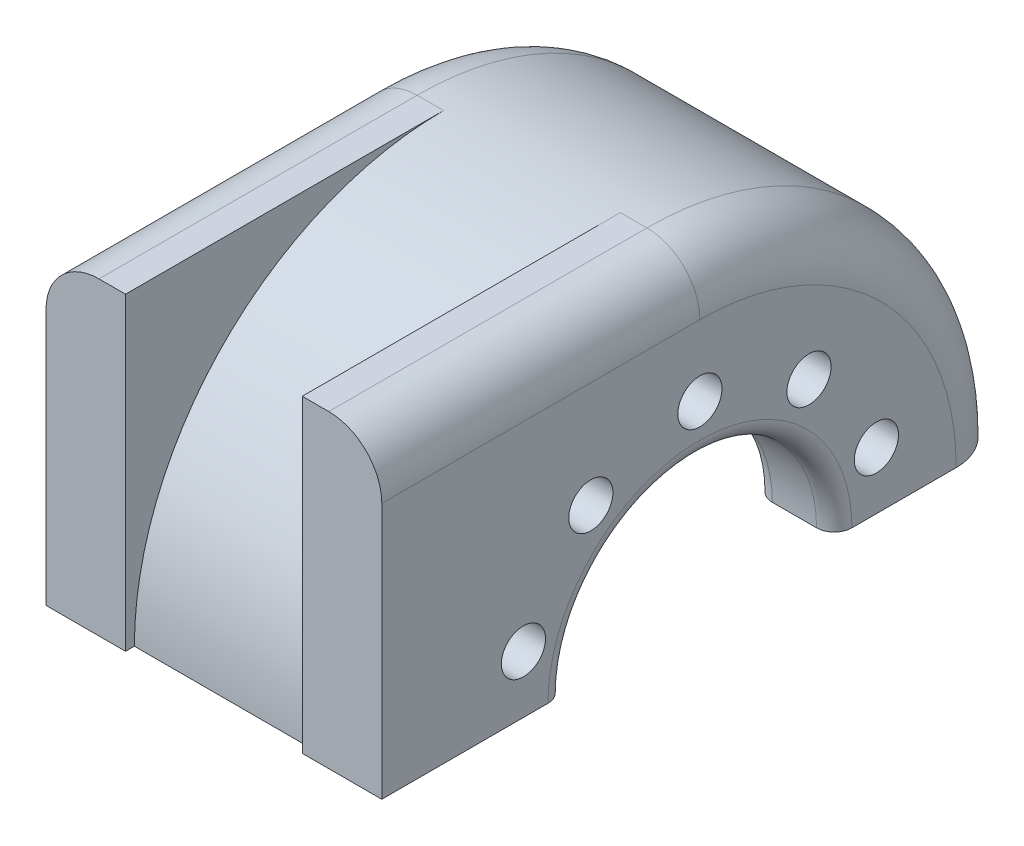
from build123d import *

# Parameters (mm, degrees)
ESTRUSIONE_ESTRUSIONE2_DEPTH = 190
SCHIZZO3_R                   = 76
TAGLIO_ESTRUSIONE1_DEPTH     = 315.841229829
SCHIZZO4_R                   = 101
TAGLIO_ESTRUSIONE2_DEPTH     = 45
SCHIZZO5_R                   = 131
TAGLIO_ESTRUSIONE3_DEPTH     = 100
SCHIZZO10_W                  = 355
SCHIZZO10_H                  = 175
TAGLIO_ESTRUSIONE4_DEPTH     = 315.841229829
RACCORDO1_R                  = 5
RACCORDO2_R                  = 5
RACCORDO3_R                  = 10
RIPETIZIONECIRCOLARE1_COUNT  = 10
RACCORDO4_R                  = 10
RACCORDO5_R                  = 30
TAGLIO_ESTRUSIONE5_START     = 100
TAGLIO_ESTRUSIONE5_DEPTH     = 100


with BuildPart() as part:
    # Schizzo1 → Estrusione-Estrusione2 (new body)
    with BuildSketch(Plane(origin=(0, 0, 0), x_dir=(0, 0, -1), z_dir=(1, 0, 0))):
        with BuildLine():
            Line((-180, 175), (-180, -175))
            Line((-180, -175), (0, -175))
            ThreePointArc((0, -175), (175, 0), (0, 175))
            Line((0, 175), (-180, 175))
        make_face()
    extrude(amount=-ESTRUSIONE_ESTRUSIONE2_DEPTH)

    # Schizzo3 → Taglio-Estrusione1 (cut, through all)
    with BuildSketch(Plane(origin=(0, 0, 0), x_dir=(0, 0, -1), z_dir=(1, 0, 0))):
        Circle(SCHIZZO3_R)
    extrude(amount=-TAGLIO_ESTRUSIONE1_DEPTH, mode=Mode.SUBTRACT)

    # Schizzo4 → Taglio-Estrusione2 (cut)
    with BuildSketch(Plane.ZY.offset(190)):
        Circle(SCHIZZO4_R)
    extrude(amount=-TAGLIO_ESTRUSIONE2_DEPTH, mode=Mode.SUBTRACT)

    # Schizzo5 → Taglio-Estrusione3 (cut)
    with BuildSketch(Plane.ZY.offset(145)):
        Circle(SCHIZZO5_R)
    extrude(amount=-TAGLIO_ESTRUSIONE3_DEPTH, mode=Mode.SUBTRACT)

    # Schizzo8 → 25.0mm Dowel Hole1 (revolve, cut)
    with BuildSketch(Plane(origin=(0, 32.446784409, 99.860934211), x_dir=(0, 0, -1), z_dir=(0, 1, 0))):
        Polygon((0, 0), (0, 52.510757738), (12.5, 45), (12.5, 0), align=None)
    f_25_0mm_dowel_hole1 = revolve(axis=Axis((6.35, 32.446784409, 99.860934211), (-1, 0, 0)), mode=Mode.SUBTRACT)

    # Schizzo10 → Taglio-Estrusione4 (cut, through all)
    with BuildSketch(Plane(origin=(0, 0, 0), x_dir=(0, 0, -1), z_dir=(1, 0, 0))):
        with Locations((-2.5, -87.5)):
            Rectangle(SCHIZZO10_W, SCHIZZO10_H)
    extrude(amount=-TAGLIO_ESTRUSIONE4_DEPTH, mode=Mode.SUBTRACT)

    # Raccordo1
    raccordo1_edges = [part.edges().sort_by_distance(p)[0] for p in [
        (-145, 101, 0),
    ]]
    fillet(raccordo1_edges, radius=RACCORDO1_R)

    # Raccordo2
    raccordo2_edges = [part.edges().sort_by_distance(p)[0] for p in [
        (-145, 131, 0),
        (-45, 131, 0),
    ]]
    fillet(raccordo2_edges, radius=RACCORDO2_R)

    # Raccordo3
    raccordo3_edges = [part.edges().sort_by_distance(p)[0] for p in [
        (-45, 76, 0),
    ]]
    fillet(raccordo3_edges, radius=RACCORDO3_R)

    # RipetizioneCircolare1: 25.0mm Dowel Hole1 ×10 about axis, 5 skipped
    ripetizionecircolare1_axis = Axis((0, 0, 0), (1, 0, 0))
    add([f_25_0mm_dowel_hole1.rotate(ripetizionecircolare1_axis, i * 360 / RIPETIZIONECIRCOLARE1_COUNT) for i in range(1, RIPETIZIONECIRCOLARE1_COUNT) if i not in (1, 2, 3, 4, 5)], mode=Mode.SUBTRACT)

    # Raccordo4
    raccordo4_edges = [part.edges().sort_by_distance(p)[0] for p in [
        (0, 76, 0),
    ]]
    fillet(raccordo4_edges, radius=RACCORDO4_R)

    # Raccordo5
    raccordo5_edges = [part.edges().sort_by_distance(p)[0] for p in [
        (-190, 175, 90),
        (0, 123.743686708, -123.743686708),
        (-190, 123.743686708, -123.743686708),
        (0, 175, 90),
    ]]
    fillet(raccordo5_edges, radius=RACCORDO5_R)

    # Schizzo13 → Taglio-Estrusione5 (cut)
    with BuildSketch(Plane(origin=(-145, 0, 0), x_dir=(0, 0, -1), z_dir=(1, 0, 0)).offset(TAGLIO_ESTRUSIONE5_START)):
        with BuildLine():
            Line((0, 175), (-180, 175))
            Line((-180, 175), (-180, 0))
            Line((-180, 0), (-175, 0))
            ThreePointArc((-175, 0), (-123.743686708, 123.743686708), (0, 175))
        make_face()
    extrude(amount=-TAGLIO_ESTRUSIONE5_DEPTH, mode=Mode.SUBTRACT)


solid = part.part
